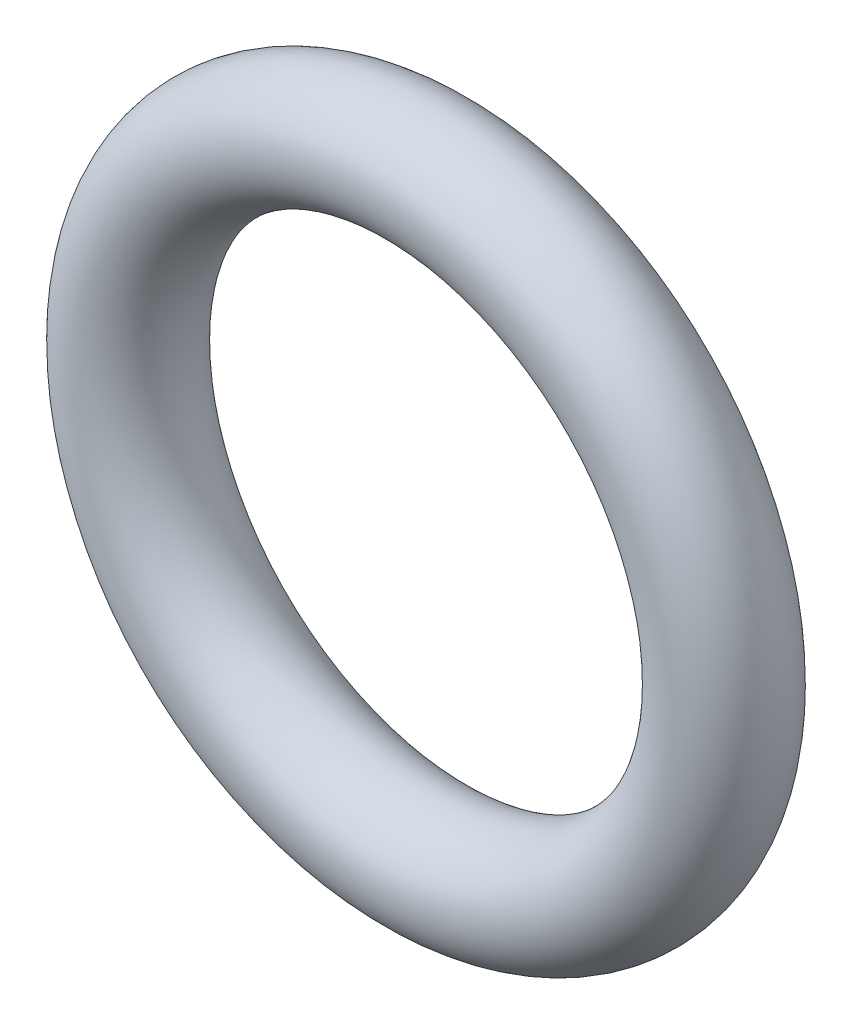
from build123d import *

# Parameters (mm, degrees)
SKETCH2_R = 0.9


with BuildPart() as part:
    # Sweep1: sweep along a path in Sketch1
    with BuildLine(Plane.XY) as sweep1_path:
        CenterArc((0, 0), 3.75, 0, 360)
    # Sketch2 → Sweep1 (sweep)
    with BuildSketch(Plane(origin=(0, 0, 0), x_dir=(1, 0, 0), z_dir=(0, 1, 0))):
        with Locations((-4.65, 0)):
            Circle(SKETCH2_R)
    sweep(path=sweep1_path.line)


solid = part.part
